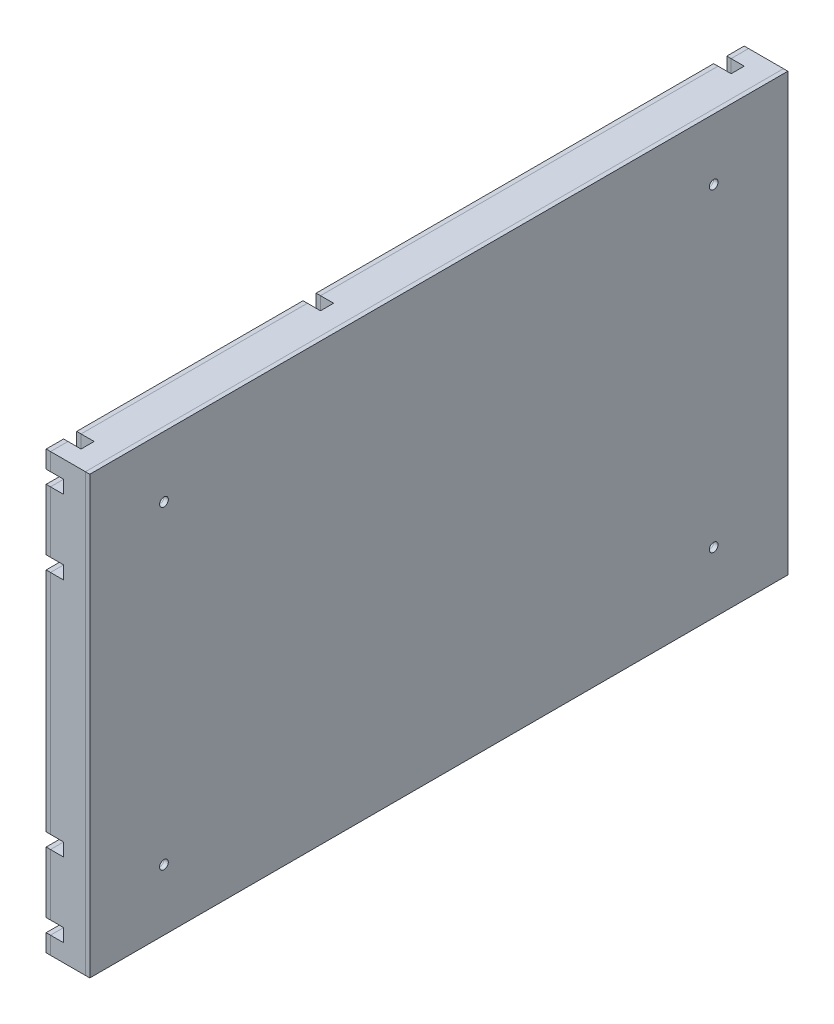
from build123d import *

# Parameters (mm, degrees)
ESQUISSE1_W             = 160
ESQUISSE1_H             = 100
EXTRUSION1_DEPTH        = 1
ESQUISSE2_W             = 160
ESQUISSE2_H             = 100
EXTRUSION4_DEPTH        = 8
ESQUISSE4_W             = 160
ESQUISSE4_H             = 100
EXTRUSION5_DEPTH        = 1
ESQUISSE5_W             = 3
ESQUISSE5_H             = 118.003052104
ESQUISSE5_H_2           = 114.049851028
ESQUISSE5_H_3           = 87.594506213
ENL_V_MAT_EXTRU_1_DEPTH = 4
ESQUISSE6_W             = 173.940847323
ESQUISSE6_H             = 3
ESQUISSE6_W_2           = 179.277668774
ESQUISSE6_W_3           = 177.696388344
ESQUISSE6_W_4           = 175.324467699
ENL_V_MAT_EXTRU_3_DEPTH = 4
ENL_V_MAT_EXTRU_4_DEPTH = 4
ENL_V_MAT_EXTRU_5_DEPTH = 4
ESQUISSE9_R             = 1
ENL_V_MAT_EXTRU_6_DEPTH = 189.944436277


with BuildPart() as part:
    # Esquisse1 → Extrusion1 (new body)
    with BuildSketch(Plane(origin=(0, 0, 0), x_dir=(0, 0, -1), z_dir=(1, 0, 0))):
        with Locations((80, 50)):
            Rectangle(ESQUISSE1_W, ESQUISSE1_H)
    extrude(amount=EXTRUSION1_DEPTH)


with BuildPart() as body_2:
    # Esquisse2 → Extrusion4 (new body)
    with BuildSketch(Plane.ZY.offset(-1)):
        with Locations((-80, 50)):
            Rectangle(ESQUISSE2_W, ESQUISSE2_H)
    extrude(amount=-EXTRUSION4_DEPTH)


with BuildPart() as body_3:
    # Esquisse4 → Extrusion5 (new body)
    with BuildSketch(Plane(origin=(9, 0, 0), x_dir=(0, 0, -1), z_dir=(1, 0, 0))):
        with Locations((80, 50)):
            Rectangle(ESQUISSE4_W, ESQUISSE4_H)
    extrude(amount=EXTRUSION5_DEPTH)


with BuildPart() as enl_v_mat_extru_1_tool:
    # Esquisse5 → Enl_v. mat.-Extru.1 (new body)
    with BuildSketch(Plane(origin=(0, 0, 0), x_dir=(0, 0, -1), z_dir=(1, 0, 0))):
        with Locations((154.5, 49.407019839)):
            Rectangle(ESQUISSE5_W, ESQUISSE5_H)
        with Locations((5.5, 50)):
            Rectangle(ESQUISSE5_W, ESQUISSE5_H_2)
        with Locations((79.5, 34.202746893)):
            Rectangle(ESQUISSE5_W, ESQUISSE5_H_3)
    extrude(amount=ENL_V_MAT_EXTRU_1_DEPTH)


with BuildPart() as part_1:
    add(part.part)

    # Enl_v. mat.-Extru.1: cut by enl_v_mat_extru_1_tool
    add(enl_v_mat_extru_1_tool.part, mode=Mode.SUBTRACT)


with BuildPart() as body_2_1:
    add(body_2.part)

    # Enl_v. mat.-Extru.1: cut by enl_v_mat_extru_1_tool
    add(enl_v_mat_extru_1_tool.part, mode=Mode.SUBTRACT)


with BuildPart() as enl_v_mat_extru_3_tool:
    # Esquisse6 → Enl_v. mat.-Extru.3 (new body)
    with BuildSketch(Plane(origin=(0, 0, 0), x_dir=(0, 0, -1), z_dir=(1, 0, 0))):
        with Locations((78.715209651, 94.5)):
            Rectangle(ESQUISSE6_W, ESQUISSE6_H)
        with Locations((74.860838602, 77.5)):
            Rectangle(ESQUISSE6_W_2, ESQUISSE6_H)
        with Locations((79.209359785, 5.5)):
            Rectangle(ESQUISSE6_W_3, ESQUISSE6_H)
        with Locations((78.023399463, 22.5)):
            Rectangle(ESQUISSE6_W_4, ESQUISSE6_H)
    extrude(amount=ENL_V_MAT_EXTRU_3_DEPTH)


with BuildPart() as part_2:
    add(part_1.part)

    # Enl_v. mat.-Extru.3: cut by enl_v_mat_extru_3_tool
    add(enl_v_mat_extru_3_tool.part, mode=Mode.SUBTRACT)


with BuildPart() as body_2_2:
    add(body_2_1.part)

    # Enl_v. mat.-Extru.3: cut by enl_v_mat_extru_3_tool
    add(enl_v_mat_extru_3_tool.part, mode=Mode.SUBTRACT)


with BuildPart() as enl_v_mat_extru_4_tool:
    # Esquisse7 → Enl_v. mat.-Extru.4 (new body)
    with BuildSketch(Plane(origin=(0, 0, 0), x_dir=(0, 0, -1), z_dir=(1, 0, 0))):
        Polygon((125.338262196, 0), (153, 76), (153.931086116, 69.786724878), (128.273111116, -0.707982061), align=None)
        Polygon((81, 24), (99.926452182, 76), (97.397983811, 77.824503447), (68.796061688, -0.75863174), (72.264714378, 0), align=None)
    extrude(amount=ENL_V_MAT_EXTRU_4_DEPTH)


with BuildPart() as part_3:
    add(part_2.part)

    # Enl_v. mat.-Extru.4: cut by enl_v_mat_extru_4_tool
    add(enl_v_mat_extru_4_tool.part, mode=Mode.SUBTRACT)


with BuildPart() as body_2_3:
    add(body_2_2.part)

    # Enl_v. mat.-Extru.4: cut by enl_v_mat_extru_4_tool
    add(enl_v_mat_extru_4_tool.part, mode=Mode.SUBTRACT)


with BuildPart() as enl_v_mat_extru_5_tool:
    # Esquisse8 → Enl_v. mat.-Extru.5 (new body)
    with BuildSketch(Plane(origin=(0, 0, 0), x_dir=(0, 0, -1), z_dir=(1, 0, 0))):
        Polygon((58.881014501, 76), (86.542752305, 0), (91.757238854, -5.555270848), (61.881014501, 76.528980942), (61.881014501, 105.212230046), (58.881014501, 105.212230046), align=None)
    extrude(amount=ENL_V_MAT_EXTRU_5_DEPTH)


with BuildPart() as part_4:
    add(part_3.part)

    # Enl_v. mat.-Extru.5: cut by enl_v_mat_extru_5_tool
    add(enl_v_mat_extru_5_tool.part, mode=Mode.SUBTRACT)


with BuildPart() as body_2_4:
    add(body_2_3.part)

    # Enl_v. mat.-Extru.5: cut by enl_v_mat_extru_5_tool
    add(enl_v_mat_extru_5_tool.part, mode=Mode.SUBTRACT)


with BuildPart() as enl_v_mat_extru_6_tool:
    # Esquisse9 → Enl_v. mat.-Extru.6 (new, through all)
    with BuildSketch(Plane(origin=(0, 0, 0), x_dir=(0, 0, -1), z_dir=(1, 0, 0))):
        with Locations(Location((143, 86, 0), (0, 0, 180))):
            Circle(ESQUISSE9_R)
        with Locations(Location((17, 86, 0), (0, 0, 180))):
            Circle(ESQUISSE9_R)
        with Locations(Location((17, 14, 0), (0, 0, 180))):
            Circle(ESQUISSE9_R)
        with Locations(Location((143, 14, 0), (0, 0, 180))):
            Circle(ESQUISSE9_R)
    extrude(amount=ENL_V_MAT_EXTRU_6_DEPTH)


with BuildPart() as part_5:
    add(part_4.part)

    # Enl_v. mat.-Extru.6: cut by enl_v_mat_extru_6_tool
    add(enl_v_mat_extru_6_tool.part, mode=Mode.SUBTRACT)


with BuildPart() as body_2_5:
    add(body_2_4.part)

    # Enl_v. mat.-Extru.6: cut by enl_v_mat_extru_6_tool
    add(enl_v_mat_extru_6_tool.part, mode=Mode.SUBTRACT)


with BuildPart() as body_3_1:
    add(body_3.part)

    # Enl_v. mat.-Extru.6: cut by enl_v_mat_extru_6_tool
    add(enl_v_mat_extru_6_tool.part, mode=Mode.SUBTRACT)


solid = Compound([part_5.part, body_2_5.part, body_3_1.part])
